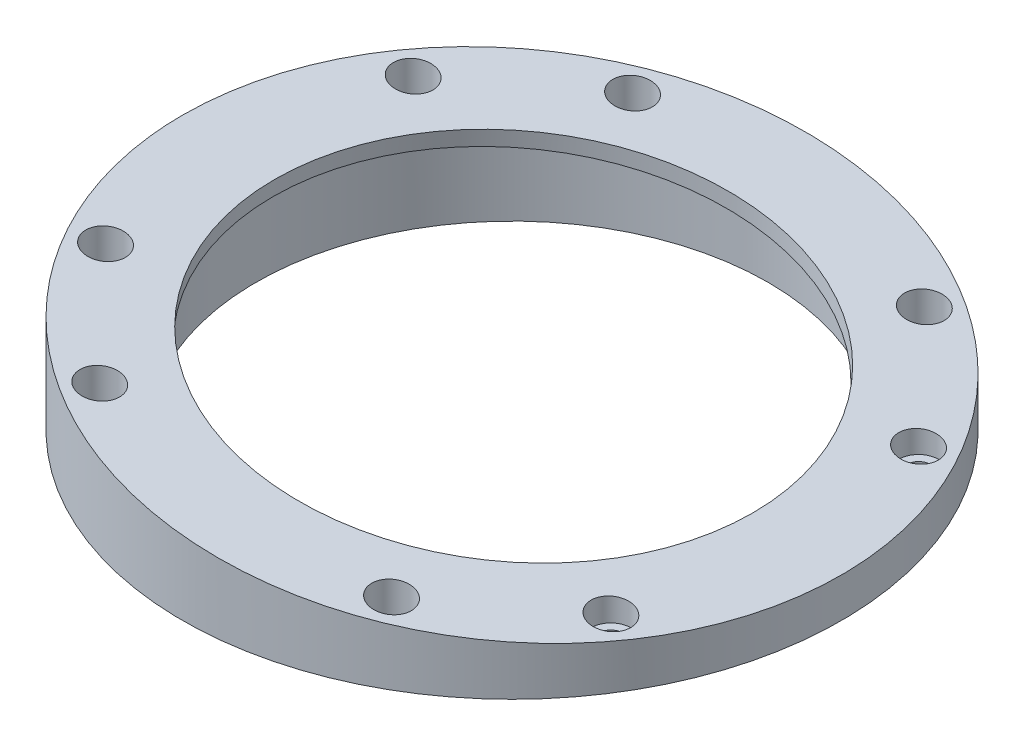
ISO-10303-21;
HEADER;
FILE_DESCRIPTION(('STEP AP214'),'2;1');
FILE_NAME('part.step','',(''),(''),'','','');
FILE_SCHEMA(('AUTOMOTIVE_DESIGN { 1 0 10303 214 1 1 1 1 }'));
ENDSEC;
DATA;
#1=APPLICATION_CONTEXT('core data for automotive mechanical design processes');
#2=APPLICATION_PROTOCOL_DEFINITION('international standard','automotive_design',2000,#1);
#3=PRODUCT_CONTEXT('',#1,'mechanical');
#4=PRODUCT('Part','Part','',(#3));
#5=PRODUCT_RELATED_PRODUCT_CATEGORY('part','',(#4));
#6=PRODUCT_DEFINITION_FORMATION('','',#4);
#7=PRODUCT_DEFINITION_CONTEXT('part definition',#1,'design');
#8=PRODUCT_DEFINITION('design','',#6,#7);
#9=PRODUCT_DEFINITION_SHAPE('','',#8);
#10=(LENGTH_UNIT() NAMED_UNIT(*) SI_UNIT(.MILLI.,.METRE.));
#11=(NAMED_UNIT(*) PLANE_ANGLE_UNIT() SI_UNIT($,.RADIAN.));
#12=(NAMED_UNIT(*) SI_UNIT($,.STERADIAN.) SOLID_ANGLE_UNIT());
#13=UNCERTAINTY_MEASURE_WITH_UNIT(LENGTH_MEASURE(1.E-05),#10,'distance_accuracy_value','');
#14=(GEOMETRIC_REPRESENTATION_CONTEXT(3) GLOBAL_UNCERTAINTY_ASSIGNED_CONTEXT((#13)) GLOBAL_UNIT_ASSIGNED_CONTEXT((#10,
#11,#12)) REPRESENTATION_CONTEXT('',''));
#15=CARTESIAN_POINT('',(0.,0.,0.));
#16=DIRECTION('',(0.,0.,1.));
#17=DIRECTION('',(1.,0.,0.));
#18=AXIS2_PLACEMENT_3D('',#15,#16,#17);
#19=CARTESIAN_POINT('',(127.,0.,127.));
#20=DIRECTION('',(0.,1.,0.));
#21=DIRECTION('',(0.,0.,1.));
#22=AXIS2_PLACEMENT_3D('',#19,#20,#21);
#23=CYLINDRICAL_SURFACE('',#22,66.167);
#24=CARTESIAN_POINT('',(127.,247.103942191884,127.));
#25=DIRECTION('',(-0.103660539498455,-0.994612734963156,0.));
#26=DIRECTION('',(-0.994612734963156,0.103660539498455,0.));
#27=AXIS2_PLACEMENT_3D('',#24,#25,#26);
#28=ELLIPSE('',#27,66.525389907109,66.167);
#29=CARTESIAN_POINT('',(60.833,254.,127.));
#30=VERTEX_POINT('',#29);
#31=EDGE_CURVE('E12',#30,#30,#28,.T.);
#32=ORIENTED_EDGE('',*,*,#31,.T.);
#33=EDGE_LOOP('',(#32));
#34=FACE_BOUND('',#33,.T.);
#35=CARTESIAN_POINT('',(127.,232.283,127.));
#36=DIRECTION('',(0.,-1.,0.));
#37=DIRECTION('',(0.,0.,-1.));
#38=AXIS2_PLACEMENT_3D('',#35,#36,#37);
#39=CIRCLE('',#38,66.167);
#40=CARTESIAN_POINT('',(127.,232.283,60.833));
#41=VERTEX_POINT('',#40);
#42=EDGE_CURVE('E50',#41,#41,#39,.T.);
#43=ORIENTED_EDGE('',*,*,#42,.F.);
#44=EDGE_LOOP('',(#43));
#45=FACE_BOUND('',#44,.T.);
#46=ADVANCED_FACE('F42',(#34,#45),#23,.T.);
#47=CARTESIAN_POINT('',(26.8416130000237,257.542650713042,60.832));
#48=DIRECTION('',(-0.103660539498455,-0.994612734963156,0.));
#49=DIRECTION('',(0.994612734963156,-0.103660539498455,0.));
#50=AXIS2_PLACEMENT_3D('',#47,#48,#49);
#51=PLANE('',#50);
#52=CARTESIAN_POINT('',(127.329122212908,247.069640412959,127.));
#53=DIRECTION('',(-0.103660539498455,-0.994612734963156,0.));
#54=DIRECTION('',(0.994612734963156,-0.103660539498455,0.));
#55=AXIS2_PLACEMENT_3D('',#52,#53,#54);
#56=CIRCLE('',#55,48.26);
#57=CARTESIAN_POINT('',(175.32913280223,242.066982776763,127.));
#58=VERTEX_POINT('',#57);
#59=EDGE_CURVE('E409',#58,#58,#56,.T.);
#60=ORIENTED_EDGE('',*,*,#59,.T.);
#61=EDGE_LOOP('',(#60));
#62=FACE_BOUND('',#61,.T.);
#63=CARTESIAN_POINT('',(75.6807048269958,252.452542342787,95.5336504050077));
#64=DIRECTION('',(-0.103660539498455,-0.994612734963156,0.));
#65=DIRECTION('',(-0.994612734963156,0.103660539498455,0.));
#66=AXIS2_PLACEMENT_3D('',#63,#64,#65);
#67=ELLIPSE('',#66,3.99024651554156,3.96874999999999);
#68=CARTESIAN_POINT('',(71.7119548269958,252.86617344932,95.5336504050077));
#69=VERTEX_POINT('',#68);
#70=EDGE_CURVE('E45',#69,#69,#67,.F.);
#71=ORIENTED_EDGE('',*,*,#70,.F.);
#72=EDGE_LOOP('',(#71));
#73=FACE_BOUND('',#72,.T.);
#74=CARTESIAN_POINT('',(158.46634274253,243.824456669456,75.6807202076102));
#75=DIRECTION('',(-0.103660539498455,-0.994612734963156,0.));
#76=DIRECTION('',(-0.994612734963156,0.103660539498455,0.));
#77=AXIS2_PLACEMENT_3D('',#74,#75,#76);
#78=ELLIPSE('',#77,3.99024651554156,3.96874999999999);
#79=CARTESIAN_POINT('',(154.49759274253,244.238087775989,75.6807202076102));
#80=VERTEX_POINT('',#79);
#81=EDGE_CURVE('E170',#80,#80,#78,.F.);
#82=ORIENTED_EDGE('',*,*,#81,.F.);
#83=EDGE_LOOP('',(#82));
#84=FACE_BOUND('',#83,.T.);
#85=CARTESIAN_POINT('',(179.910292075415,241.589525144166,98.2893713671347));
#86=DIRECTION('',(-0.103660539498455,-0.994612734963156,0.));
#87=DIRECTION('',(-0.994612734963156,0.103660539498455,0.));
#88=AXIS2_PLACEMENT_3D('',#85,#86,#87);
#89=ELLIPSE('',#88,3.99024651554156,3.96874999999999);
#90=CARTESIAN_POINT('',(175.941542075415,242.003156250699,98.2893713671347));
#91=VERTEX_POINT('',#90);
#92=EDGE_CURVE('E168',#91,#91,#89,.F.);
#93=ORIENTED_EDGE('',*,*,#92,.F.);
#94=EDGE_LOOP('',(#93));
#95=FACE_BOUND('',#94,.T.);
#96=CARTESIAN_POINT('',(178.319279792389,241.75534364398,158.466342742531));
#97=DIRECTION('',(-0.103660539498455,-0.994612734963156,0.));
#98=DIRECTION('',(-0.994612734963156,0.103660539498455,0.));
#99=AXIS2_PLACEMENT_3D('',#96,#97,#98);
#100=ELLIPSE('',#99,3.99024651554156,3.96874999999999);
#101=CARTESIAN_POINT('',(174.350529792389,242.168974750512,158.466342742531));
#102=VERTEX_POINT('',#101);
#103=EDGE_CURVE('E165',#102,#102,#100,.F.);
#104=ORIENTED_EDGE('',*,*,#103,.F.);
#105=EDGE_LOOP('',(#104));
#106=FACE_BOUND('',#105,.T.);
#107=CARTESIAN_POINT('',(155.710628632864,244.111662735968,179.910292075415));
#108=DIRECTION('',(-0.103660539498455,-0.994612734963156,0.));
#109=DIRECTION('',(-0.994612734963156,0.103660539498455,0.));
#110=AXIS2_PLACEMENT_3D('',#107,#108,#109);
#111=ELLIPSE('',#110,3.99024651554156,3.96874999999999);
#112=CARTESIAN_POINT('',(151.741878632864,244.525293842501,179.910292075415));
#113=VERTEX_POINT('',#112);
#114=EDGE_CURVE('E162',#113,#113,#111,.F.);
#115=ORIENTED_EDGE('',*,*,#114,.F.);
#116=EDGE_LOOP('',(#115));
#117=FACE_BOUND('',#116,.T.);
#118=CARTESIAN_POINT('',(95.5336572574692,250.383427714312,178.31927979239));
#119=DIRECTION('',(-0.103660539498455,-0.994612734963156,0.));
#120=DIRECTION('',(-0.994612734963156,0.103660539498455,0.));
#121=AXIS2_PLACEMENT_3D('',#118,#119,#120);
#122=ELLIPSE('',#121,3.99024651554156,3.96874999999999);
#123=CARTESIAN_POINT('',(91.5649072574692,250.797058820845,178.31927979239));
#124=VERTEX_POINT('',#123);
#125=EDGE_CURVE('E159',#124,#124,#122,.F.);
#126=ORIENTED_EDGE('',*,*,#125,.F.);
#127=EDGE_LOOP('',(#126));
#128=FACE_BOUND('',#127,.T.);
#129=CARTESIAN_POINT('',(74.0897079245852,252.618359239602,155.710628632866));
#130=DIRECTION('',(-0.103660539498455,-0.994612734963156,0.));
#131=DIRECTION('',(-0.994612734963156,0.103660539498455,0.));
#132=AXIS2_PLACEMENT_3D('',#129,#130,#131);
#133=ELLIPSE('',#132,3.99024651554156,3.96874999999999);
#134=CARTESIAN_POINT('',(70.1209579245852,253.031990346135,155.710628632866));
#135=VERTEX_POINT('',#134);
#136=EDGE_CURVE('E156',#135,#135,#133,.F.);
#137=ORIENTED_EDGE('',*,*,#136,.F.);
#138=EDGE_LOOP('',(#137));
#139=FACE_BOUND('',#138,.T.);
#140=CARTESIAN_POINT('',(98.2893559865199,250.096223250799,74.0897010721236));
#141=DIRECTION('',(-0.103660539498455,-0.994612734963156,0.));
#142=DIRECTION('',(-0.994612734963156,0.103660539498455,0.));
#143=AXIS2_PLACEMENT_3D('',#140,#141,#142);
#144=ELLIPSE('',#143,3.99024651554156,3.96874999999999);
#145=CARTESIAN_POINT('',(94.3206059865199,250.509854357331,74.0897010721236));
#146=VERTEX_POINT('',#145);
#147=EDGE_CURVE('E153',#146,#146,#144,.F.);
#148=ORIENTED_EDGE('',*,*,#147,.F.);
#149=EDGE_LOOP('',(#148));
#150=FACE_BOUND('',#149,.T.);
#151=ORIENTED_EDGE('',*,*,#31,.F.);
#152=EDGE_LOOP('',(#151));
#153=FACE_BOUND('',#152,.T.);
#154=ADVANCED_FACE('F214',(#62,#73,#84,#95,#106,#117,#128,#139,#150,#153),#51,.F.);
#155=CARTESIAN_POINT('',(127.,232.283,127.));
#156=DIRECTION('',(0.,-1.,0.));
#157=DIRECTION('',(0.,0.,-1.));
#158=AXIS2_PLACEMENT_3D('',#155,#156,#157);
#159=PLANE('',#158);
#160=CARTESIAN_POINT('',(127.,232.283,127.));
#161=DIRECTION('',(0.,-1.,0.));
#162=DIRECTION('',(0.,0.,-1.));
#163=AXIS2_PLACEMENT_3D('',#160,#161,#162);
#164=CIRCLE('',#163,51.435);
#165=CARTESIAN_POINT('',(127.,232.283,75.565));
#166=VERTEX_POINT('',#165);
#167=EDGE_CURVE('E410',#166,#166,#164,.T.);
#168=ORIENTED_EDGE('',*,*,#167,.F.);
#169=EDGE_LOOP('',(#168));
#170=FACE_BOUND('',#169,.T.);
#171=CARTESIAN_POINT('',(158.46634274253,232.283,75.6807202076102));
#172=DIRECTION('',(0.,-1.,0.));
#173=DIRECTION('',(0.,0.,-1.));
#174=AXIS2_PLACEMENT_3D('',#171,#172,#173);
#175=CIRCLE('',#174,2.2479);
#176=CARTESIAN_POINT('',(158.46634274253,232.283,73.4328202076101));
#177=VERTEX_POINT('',#176);
#178=EDGE_CURVE('E175',#177,#177,#175,.T.);
#179=ORIENTED_EDGE('',*,*,#178,.F.);
#180=EDGE_LOOP('',(#179));
#181=FACE_BOUND('',#180,.T.);
#182=CARTESIAN_POINT('',(179.910292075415,232.283,98.2893713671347));
#183=DIRECTION('',(0.,-1.,0.));
#184=DIRECTION('',(0.,0.,-1.));
#185=AXIS2_PLACEMENT_3D('',#182,#183,#184);
#186=CIRCLE('',#185,2.2479);
#187=CARTESIAN_POINT('',(179.910292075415,232.283,96.0414713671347));
#188=VERTEX_POINT('',#187);
#189=EDGE_CURVE('E179',#188,#188,#186,.T.);
#190=ORIENTED_EDGE('',*,*,#189,.F.);
#191=EDGE_LOOP('',(#190));
#192=FACE_BOUND('',#191,.T.);
#193=CARTESIAN_POINT('',(178.319279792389,232.283,158.466342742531));
#194=DIRECTION('',(0.,-1.,0.));
#195=DIRECTION('',(0.,0.,-1.));
#196=AXIS2_PLACEMENT_3D('',#193,#194,#195);
#197=CIRCLE('',#196,2.2479);
#198=CARTESIAN_POINT('',(178.319279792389,232.283,156.218442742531));
#199=VERTEX_POINT('',#198);
#200=EDGE_CURVE('E184',#199,#199,#197,.T.);
#201=ORIENTED_EDGE('',*,*,#200,.F.);
#202=EDGE_LOOP('',(#201));
#203=FACE_BOUND('',#202,.T.);
#204=CARTESIAN_POINT('',(155.710628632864,232.283,179.910292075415));
#205=DIRECTION('',(0.,-1.,0.));
#206=DIRECTION('',(0.,0.,-1.));
#207=AXIS2_PLACEMENT_3D('',#204,#205,#206);
#208=CIRCLE('',#207,2.2479);
#209=CARTESIAN_POINT('',(155.710628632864,232.283,177.662392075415));
#210=VERTEX_POINT('',#209);
#211=EDGE_CURVE('E191',#210,#210,#208,.T.);
#212=ORIENTED_EDGE('',*,*,#211,.F.);
#213=EDGE_LOOP('',(#212));
#214=FACE_BOUND('',#213,.T.);
#215=CARTESIAN_POINT('',(95.5336572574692,232.283,178.31927979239));
#216=DIRECTION('',(0.,-1.,0.));
#217=DIRECTION('',(0.,0.,-1.));
#218=AXIS2_PLACEMENT_3D('',#215,#216,#217);
#219=CIRCLE('',#218,2.2479);
#220=CARTESIAN_POINT('',(95.5336572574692,232.283,176.07137979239));
#221=VERTEX_POINT('',#220);
#222=EDGE_CURVE('E194',#221,#221,#219,.T.);
#223=ORIENTED_EDGE('',*,*,#222,.F.);
#224=EDGE_LOOP('',(#223));
#225=FACE_BOUND('',#224,.T.);
#226=CARTESIAN_POINT('',(74.0897079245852,232.283,155.710628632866));
#227=DIRECTION('',(0.,-1.,0.));
#228=DIRECTION('',(0.,0.,-1.));
#229=AXIS2_PLACEMENT_3D('',#226,#227,#228);
#230=CIRCLE('',#229,2.2479);
#231=CARTESIAN_POINT('',(74.0897079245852,232.283,153.462728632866));
#232=VERTEX_POINT('',#231);
#233=EDGE_CURVE('E197',#232,#232,#230,.T.);
#234=ORIENTED_EDGE('',*,*,#233,.F.);
#235=EDGE_LOOP('',(#234));
#236=FACE_BOUND('',#235,.T.);
#237=CARTESIAN_POINT('',(75.6807048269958,232.283,95.5336504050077));
#238=DIRECTION('',(0.,-1.,0.));
#239=DIRECTION('',(0.,0.,-1.));
#240=AXIS2_PLACEMENT_3D('',#237,#238,#239);
#241=CIRCLE('',#240,2.2479);
#242=CARTESIAN_POINT('',(75.6807048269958,232.283,93.2857504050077));
#243=VERTEX_POINT('',#242);
#244=EDGE_CURVE('E200',#243,#243,#241,.T.);
#245=ORIENTED_EDGE('',*,*,#244,.F.);
#246=EDGE_LOOP('',(#245));
#247=FACE_BOUND('',#246,.T.);
#248=CARTESIAN_POINT('',(98.2893559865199,232.283,74.0897010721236));
#249=DIRECTION('',(0.,-1.,0.));
#250=DIRECTION('',(0.,0.,-1.));
#251=AXIS2_PLACEMENT_3D('',#248,#249,#250);
#252=CIRCLE('',#251,2.2479);
#253=CARTESIAN_POINT('',(98.2893559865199,232.283,71.8418010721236));
#254=VERTEX_POINT('',#253);
#255=EDGE_CURVE('E203',#254,#254,#252,.T.);
#256=ORIENTED_EDGE('',*,*,#255,.F.);
#257=EDGE_LOOP('',(#256));
#258=FACE_BOUND('',#257,.T.);
#259=CARTESIAN_POINT('',(67.2038955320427,232.283,125.419057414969));
#260=DIRECTION('',(0.,-1.,0.));
#261=DIRECTION('',(0.,0.,-1.));
#262=AXIS2_PLACEMENT_3D('',#259,#260,#261);
#263=CIRCLE('',#262,2.0574);
#264=CARTESIAN_POINT('',(67.2038955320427,232.283,123.361657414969));
#265=VERTEX_POINT('',#264);
#266=EDGE_CURVE('E87',#265,#265,#263,.T.);
#267=ORIENTED_EDGE('',*,*,#266,.F.);
#268=EDGE_LOOP('',(#267));
#269=FACE_BOUND('',#268,.T.);
#270=CARTESIAN_POINT('',(128.580942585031,232.283,67.2038955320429));
#271=DIRECTION('',(0.,-1.,0.));
#272=DIRECTION('',(0.,0.,-1.));
#273=AXIS2_PLACEMENT_3D('',#270,#271,#272);
#274=CIRCLE('',#273,2.05739999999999);
#275=CARTESIAN_POINT('',(128.580942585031,232.283,65.1464955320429));
#276=VERTEX_POINT('',#275);
#277=EDGE_CURVE('E80',#276,#276,#274,.T.);
#278=ORIENTED_EDGE('',*,*,#277,.F.);
#279=EDGE_LOOP('',(#278));
#280=FACE_BOUND('',#279,.T.);
#281=CARTESIAN_POINT('',(186.796104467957,232.283,128.580942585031));
#282=DIRECTION('',(0.,-1.,0.));
#283=DIRECTION('',(0.,0.,-1.));
#284=AXIS2_PLACEMENT_3D('',#281,#282,#283);
#285=CIRCLE('',#284,2.05739999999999);
#286=CARTESIAN_POINT('',(186.796104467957,232.283,126.523542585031));
#287=VERTEX_POINT('',#286);
#288=EDGE_CURVE('E96',#287,#287,#285,.T.);
#289=ORIENTED_EDGE('',*,*,#288,.F.);
#290=EDGE_LOOP('',(#289));
#291=FACE_BOUND('',#290,.T.);
#292=CARTESIAN_POINT('',(125.419057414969,232.283,186.796104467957));
#293=DIRECTION('',(0.,-1.,0.));
#294=DIRECTION('',(0.,0.,-1.));
#295=AXIS2_PLACEMENT_3D('',#292,#293,#294);
#296=CIRCLE('',#295,2.05740000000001);
#297=CARTESIAN_POINT('',(125.419057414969,232.283,184.738704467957));
#298=VERTEX_POINT('',#297);
#299=EDGE_CURVE('E105',#298,#298,#296,.T.);
#300=ORIENTED_EDGE('',*,*,#299,.F.);
#301=EDGE_LOOP('',(#300));
#302=FACE_BOUND('',#301,.T.);
#303=CARTESIAN_POINT('',(168.465088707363,232.283,87.6710168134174));
#304=DIRECTION('',(0.,-1.,0.));
#305=DIRECTION('',(0.,0.,-1.));
#306=AXIS2_PLACEMENT_3D('',#303,#304,#305);
#307=CIRCLE('',#306,0.793749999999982);
#308=CARTESIAN_POINT('',(168.465088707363,232.283,86.8772668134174));
#309=VERTEX_POINT('',#308);
#310=EDGE_CURVE('E114',#309,#309,#307,.T.);
#311=ORIENTED_EDGE('',*,*,#310,.F.);
#312=EDGE_LOOP('',(#311));
#313=FACE_BOUND('',#312,.T.);
#314=CARTESIAN_POINT('',(85.5349112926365,232.283,166.328983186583));
#315=DIRECTION('',(0.,-1.,0.));
#316=DIRECTION('',(0.,0.,-1.));
#317=AXIS2_PLACEMENT_3D('',#314,#315,#316);
#318=CIRCLE('',#317,0.793749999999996);
#319=CARTESIAN_POINT('',(85.5349112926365,232.283,165.535233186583));
#320=VERTEX_POINT('',#319);
#321=EDGE_CURVE('E120',#320,#320,#318,.T.);
#322=ORIENTED_EDGE('',*,*,#321,.F.);
#323=EDGE_LOOP('',(#322));
#324=FACE_BOUND('',#323,.T.);
#325=ORIENTED_EDGE('',*,*,#42,.T.);
#326=EDGE_LOOP('',(#325));
#327=FACE_BOUND('',#326,.T.);
#328=ADVANCED_FACE('F210',(#170,#181,#192,#203,#214,#225,#236,#247,#258,#269,#280,#291,#302,
#313,#324,#327),#159,.T.);
#329=CARTESIAN_POINT('',(26.5124907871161,254.384755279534,60.832));
#330=DIRECTION('',(-0.103660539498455,-0.994612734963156,0.));
#331=DIRECTION('',(0.994612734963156,-0.103660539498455,0.));
#332=AXIS2_PLACEMENT_3D('',#329,#330,#331);
#333=PLANE('',#332);
#334=CARTESIAN_POINT('',(127.,243.911744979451,127.));
#335=DIRECTION('',(-0.103660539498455,-0.994612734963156,0.));
#336=DIRECTION('',(0.994612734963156,-0.103660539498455,0.));
#337=AXIS2_PLACEMENT_3D('',#334,#335,#336);
#338=CIRCLE('',#337,48.26);
#339=CARTESIAN_POINT('',(175.000010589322,238.909087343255,127.));
#340=VERTEX_POINT('',#339);
#341=EDGE_CURVE('E407',#340,#340,#338,.T.);
#342=ORIENTED_EDGE('',*,*,#341,.F.);
#343=EDGE_LOOP('',(#342));
#344=FACE_BOUND('',#343,.T.);
#345=CARTESIAN_POINT('',(127.,243.911744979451,127.));
#346=DIRECTION('',(-0.103660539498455,-0.994612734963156,0.));
#347=DIRECTION('',(0.994612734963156,-0.103660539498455,0.));
#348=AXIS2_PLACEMENT_3D('',#345,#346,#347);
#349=ELLIPSE('',#348,51.7135948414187,51.435);
#350=CARTESIAN_POINT('',(178.435,238.551085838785,127.));
#351=VERTEX_POINT('',#350);
#352=EDGE_CURVE('E413',#351,#351,#349,.F.);
#353=ORIENTED_EDGE('',*,*,#352,.F.);
#354=EDGE_LOOP('',(#353));
#355=FACE_BOUND('',#354,.T.);
#356=ADVANCED_FACE('F213',(#344,#355),#333,.T.);
#357=CARTESIAN_POINT('',(85.5349112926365,238.633,166.328983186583));
#358=DIRECTION('',(0.,-1.,0.));
#359=DIRECTION('',(0.,0.,-1.));
#360=AXIS2_PLACEMENT_3D('',#357,#358,#359);
#361=CONICAL_SURFACE('',#360,0.793749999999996,1.02974425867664);
#362=CARTESIAN_POINT('',(85.5349112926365,239.109933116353,166.328983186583));
#363=VERTEX_POINT('',#362);
#364=VERTEX_LOOP('',#363);
#365=FACE_BOUND('',#364,.T.);
#366=CARTESIAN_POINT('',(85.5349112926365,238.633,166.328983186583));
#367=DIRECTION('',(0.,-1.,0.));
#368=DIRECTION('',(0.,0.,-1.));
#369=AXIS2_PLACEMENT_3D('',#366,#367,#368);
#370=CIRCLE('',#369,0.793749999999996);
#371=CARTESIAN_POINT('',(85.5349112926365,238.633,165.535233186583));
#372=VERTEX_POINT('',#371);
#373=EDGE_CURVE('E123',#372,#372,#370,.T.);
#374=ORIENTED_EDGE('',*,*,#373,.T.);
#375=EDGE_LOOP('',(#374));
#376=FACE_BOUND('',#375,.T.);
#377=ADVANCED_FACE('F244',(#365,#376),#361,.F.);
#378=CARTESIAN_POINT('',(85.5349112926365,232.283,166.328983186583));
#379=DIRECTION('',(0.,-1.,0.));
#380=DIRECTION('',(0.,0.,-1.));
#381=AXIS2_PLACEMENT_3D('',#378,#379,#380);
#382=CYLINDRICAL_SURFACE('',#381,0.793749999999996);
#383=ORIENTED_EDGE('',*,*,#373,.F.);
#384=EDGE_LOOP('',(#383));
#385=FACE_BOUND('',#384,.T.);
#386=ORIENTED_EDGE('',*,*,#321,.T.);
#387=EDGE_LOOP('',(#386));
#388=FACE_BOUND('',#387,.T.);
#389=ADVANCED_FACE('F248',(#385,#388),#382,.F.);
#390=CARTESIAN_POINT('',(168.465088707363,238.633,87.6710168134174));
#391=DIRECTION('',(0.,-1.,0.));
#392=DIRECTION('',(0.,0.,-1.));
#393=AXIS2_PLACEMENT_3D('',#390,#391,#392);
#394=CONICAL_SURFACE('',#393,0.79375000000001,1.02974425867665);
#395=CARTESIAN_POINT('',(168.465088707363,239.109933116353,87.6710168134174));
#396=VERTEX_POINT('',#395);
#397=VERTEX_LOOP('',#396);
#398=FACE_BOUND('',#397,.T.);
#399=CARTESIAN_POINT('',(168.465088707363,238.633,87.6710168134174));
#400=DIRECTION('',(0.,-1.,0.));
#401=DIRECTION('',(0.,0.,-1.));
#402=AXIS2_PLACEMENT_3D('',#399,#400,#401);
#403=CIRCLE('',#402,0.79375000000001);
#404=CARTESIAN_POINT('',(168.465088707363,238.633,86.8772668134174));
#405=VERTEX_POINT('',#404);
#406=EDGE_CURVE('E117',#405,#405,#403,.T.);
#407=ORIENTED_EDGE('',*,*,#406,.T.);
#408=EDGE_LOOP('',(#407));
#409=FACE_BOUND('',#408,.T.);
#410=ADVANCED_FACE('F251',(#398,#409),#394,.F.);
#411=CARTESIAN_POINT('',(168.465088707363,232.283,87.6710168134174));
#412=DIRECTION('',(0.,-1.,0.));
#413=DIRECTION('',(0.,0.,-1.));
#414=AXIS2_PLACEMENT_3D('',#411,#412,#413);
#415=CYLINDRICAL_SURFACE('',#414,0.793749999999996);
#416=ORIENTED_EDGE('',*,*,#406,.F.);
#417=EDGE_LOOP('',(#416));
#418=FACE_BOUND('',#417,.T.);
#419=ORIENTED_EDGE('',*,*,#310,.T.);
#420=EDGE_LOOP('',(#419));
#421=FACE_BOUND('',#420,.T.);
#422=ADVANCED_FACE('F255',(#418,#421),#415,.F.);
#423=CARTESIAN_POINT('',(125.419057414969,238.633,186.796104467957));
#424=DIRECTION('',(0.,-1.,0.));
#425=DIRECTION('',(0.,0.,-1.));
#426=AXIS2_PLACEMENT_3D('',#423,#424,#425);
#427=CONICAL_SURFACE('',#426,1.1303,1.02974425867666);
#428=CARTESIAN_POINT('',(125.419057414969,239.312152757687,186.796104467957));
#429=VERTEX_POINT('',#428);
#430=VERTEX_LOOP('',#429);
#431=FACE_BOUND('',#430,.T.);
#432=CARTESIAN_POINT('',(125.419057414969,238.633,186.796104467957));
#433=DIRECTION('',(0.,-1.,0.));
#434=DIRECTION('',(0.,0.,-1.));
#435=AXIS2_PLACEMENT_3D('',#432,#433,#434);
#436=CIRCLE('',#435,1.1303);
#437=CARTESIAN_POINT('',(125.419057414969,238.633,185.665804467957));
#438=VERTEX_POINT('',#437);
#439=EDGE_CURVE('E111',#438,#438,#436,.T.);
#440=ORIENTED_EDGE('',*,*,#439,.T.);
#441=EDGE_LOOP('',(#440));
#442=FACE_BOUND('',#441,.T.);
#443=ADVANCED_FACE('F258',(#431,#442),#427,.F.);
#444=CARTESIAN_POINT('',(125.419057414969,232.283,186.796104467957));
#445=DIRECTION('',(0.,-1.,0.));
#446=DIRECTION('',(0.,0.,-1.));
#447=AXIS2_PLACEMENT_3D('',#444,#445,#446);
#448=CYLINDRICAL_SURFACE('',#447,1.1303);
#449=ORIENTED_EDGE('',*,*,#439,.F.);
#450=EDGE_LOOP('',(#449));
#451=FACE_BOUND('',#450,.T.);
#452=CARTESIAN_POINT('',(125.419057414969,233.060929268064,186.796104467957));
#453=DIRECTION('',(0.,-1.,0.));
#454=DIRECTION('',(0.,0.,-1.));
#455=AXIS2_PLACEMENT_3D('',#452,#453,#454);
#456=CIRCLE('',#455,1.1303);
#457=CARTESIAN_POINT('',(125.419057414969,233.060929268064,185.665804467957));
#458=VERTEX_POINT('',#457);
#459=EDGE_CURVE('E108',#458,#458,#456,.T.);
#460=ORIENTED_EDGE('',*,*,#459,.T.);
#461=EDGE_LOOP('',(#460));
#462=FACE_BOUND('',#461,.T.);
#463=ADVANCED_FACE('F262',(#451,#462),#448,.F.);
#464=CARTESIAN_POINT('',(125.419057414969,232.283,186.796104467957));
#465=DIRECTION('',(0.,-1.,0.));
#466=DIRECTION('',(0.,0.,-1.));
#467=AXIS2_PLACEMENT_3D('',#464,#465,#466);
#468=CONICAL_SURFACE('',#467,2.05740000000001,0.872664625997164);
#469=ORIENTED_EDGE('',*,*,#459,.F.);
#470=EDGE_LOOP('',(#469));
#471=FACE_BOUND('',#470,.T.);
#472=ORIENTED_EDGE('',*,*,#299,.T.);
#473=EDGE_LOOP('',(#472));
#474=FACE_BOUND('',#473,.T.);
#475=ADVANCED_FACE('F266',(#471,#474),#468,.F.);
#476=CARTESIAN_POINT('',(186.796104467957,238.633,128.580942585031));
#477=DIRECTION('',(0.,-1.,0.));
#478=DIRECTION('',(0.,0.,-1.));
#479=AXIS2_PLACEMENT_3D('',#476,#477,#478);
#480=CONICAL_SURFACE('',#479,1.1303,1.02974425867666);
#481=CARTESIAN_POINT('',(186.796104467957,239.312152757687,128.580942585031));
#482=VERTEX_POINT('',#481);
#483=VERTEX_LOOP('',#482);
#484=FACE_BOUND('',#483,.T.);
#485=CARTESIAN_POINT('',(186.796104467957,238.633,128.580942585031));
#486=DIRECTION('',(0.,-1.,0.));
#487=DIRECTION('',(0.,0.,-1.));
#488=AXIS2_PLACEMENT_3D('',#485,#486,#487);
#489=CIRCLE('',#488,1.1303);
#490=CARTESIAN_POINT('',(186.796104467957,238.633,127.450642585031));
#491=VERTEX_POINT('',#490);
#492=EDGE_CURVE('E102',#491,#491,#489,.T.);
#493=ORIENTED_EDGE('',*,*,#492,.T.);
#494=EDGE_LOOP('',(#493));
#495=FACE_BOUND('',#494,.T.);
#496=ADVANCED_FACE('F270',(#484,#495),#480,.F.);
#497=CARTESIAN_POINT('',(186.796104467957,232.283,128.580942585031));
#498=DIRECTION('',(0.,-1.,0.));
#499=DIRECTION('',(0.,0.,-1.));
#500=AXIS2_PLACEMENT_3D('',#497,#498,#499);
#501=CYLINDRICAL_SURFACE('',#500,1.1303);
#502=ORIENTED_EDGE('',*,*,#492,.F.);
#503=EDGE_LOOP('',(#502));
#504=FACE_BOUND('',#503,.T.);
#505=CARTESIAN_POINT('',(186.796104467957,233.060929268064,128.580942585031));
#506=DIRECTION('',(0.,-1.,0.));
#507=DIRECTION('',(0.,0.,-1.));
#508=AXIS2_PLACEMENT_3D('',#505,#506,#507);
#509=CIRCLE('',#508,1.1303);
#510=CARTESIAN_POINT('',(186.796104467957,233.060929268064,127.450642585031));
#511=VERTEX_POINT('',#510);
#512=EDGE_CURVE('E99',#511,#511,#509,.T.);
#513=ORIENTED_EDGE('',*,*,#512,.T.);
#514=EDGE_LOOP('',(#513));
#515=FACE_BOUND('',#514,.T.);
#516=ADVANCED_FACE('F274',(#504,#515),#501,.F.);
#517=CARTESIAN_POINT('',(186.796104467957,232.283,128.580942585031));
#518=DIRECTION('',(0.,-1.,0.));
#519=DIRECTION('',(0.,0.,-1.));
#520=AXIS2_PLACEMENT_3D('',#517,#518,#519);
#521=CONICAL_SURFACE('',#520,2.05739999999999,0.872664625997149);
#522=ORIENTED_EDGE('',*,*,#512,.F.);
#523=EDGE_LOOP('',(#522));
#524=FACE_BOUND('',#523,.T.);
#525=ORIENTED_EDGE('',*,*,#288,.T.);
#526=EDGE_LOOP('',(#525));
#527=FACE_BOUND('',#526,.T.);
#528=ADVANCED_FACE('F278',(#524,#527),#521,.F.);
#529=CARTESIAN_POINT('',(128.580942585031,238.633,67.2038955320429));
#530=DIRECTION('',(0.,-1.,0.));
#531=DIRECTION('',(0.,0.,-1.));
#532=AXIS2_PLACEMENT_3D('',#529,#530,#531);
#533=CONICAL_SURFACE('',#532,1.1303,1.02974425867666);
#534=CARTESIAN_POINT('',(128.580942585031,239.312152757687,67.2038955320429));
#535=VERTEX_POINT('',#534);
#536=VERTEX_LOOP('',#535);
#537=FACE_BOUND('',#536,.T.);
#538=CARTESIAN_POINT('',(128.580942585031,238.633,67.2038955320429));
#539=DIRECTION('',(0.,-1.,0.));
#540=DIRECTION('',(0.,0.,-1.));
#541=AXIS2_PLACEMENT_3D('',#538,#539,#540);
#542=CIRCLE('',#541,1.1303);
#543=CARTESIAN_POINT('',(128.580942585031,238.633,66.0735955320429));
#544=VERTEX_POINT('',#543);
#545=EDGE_CURVE('E93',#544,#544,#542,.T.);
#546=ORIENTED_EDGE('',*,*,#545,.T.);
#547=EDGE_LOOP('',(#546));
#548=FACE_BOUND('',#547,.T.);
#549=ADVANCED_FACE('F282',(#537,#548),#533,.F.);
#550=CARTESIAN_POINT('',(128.580942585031,232.283,67.2038955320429));
#551=DIRECTION('',(0.,-1.,0.));
#552=DIRECTION('',(0.,0.,-1.));
#553=AXIS2_PLACEMENT_3D('',#550,#551,#552);
#554=CYLINDRICAL_SURFACE('',#553,1.1303);
#555=ORIENTED_EDGE('',*,*,#545,.F.);
#556=EDGE_LOOP('',(#555));
#557=FACE_BOUND('',#556,.T.);
#558=CARTESIAN_POINT('',(128.580942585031,233.060929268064,67.2038955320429));
#559=DIRECTION('',(0.,-1.,0.));
#560=DIRECTION('',(0.,0.,-1.));
#561=AXIS2_PLACEMENT_3D('',#558,#559,#560);
#562=CIRCLE('',#561,1.1303);
#563=CARTESIAN_POINT('',(128.580942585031,233.060929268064,66.0735955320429));
#564=VERTEX_POINT('',#563);
#565=EDGE_CURVE('E84',#564,#564,#562,.T.);
#566=ORIENTED_EDGE('',*,*,#565,.T.);
#567=EDGE_LOOP('',(#566));
#568=FACE_BOUND('',#567,.T.);
#569=ADVANCED_FACE('F286',(#557,#568),#554,.F.);
#570=CARTESIAN_POINT('',(128.580942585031,232.283,67.2038955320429));
#571=DIRECTION('',(0.,-1.,0.));
#572=DIRECTION('',(0.,0.,-1.));
#573=AXIS2_PLACEMENT_3D('',#570,#571,#572);
#574=CONICAL_SURFACE('',#573,2.05739999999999,0.872664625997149);
#575=ORIENTED_EDGE('',*,*,#565,.F.);
#576=EDGE_LOOP('',(#575));
#577=FACE_BOUND('',#576,.T.);
#578=ORIENTED_EDGE('',*,*,#277,.T.);
#579=EDGE_LOOP('',(#578));
#580=FACE_BOUND('',#579,.T.);
#581=ADVANCED_FACE('F74',(#577,#580),#574,.F.);
#582=CARTESIAN_POINT('',(67.2038955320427,238.633,125.419057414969));
#583=DIRECTION('',(0.,-1.,0.));
#584=DIRECTION('',(0.,0.,-1.));
#585=AXIS2_PLACEMENT_3D('',#582,#583,#584);
#586=CONICAL_SURFACE('',#585,1.1303,1.02974425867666);
#587=CARTESIAN_POINT('',(67.2038955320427,239.312152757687,125.419057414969));
#588=VERTEX_POINT('',#587);
#589=VERTEX_LOOP('',#588);
#590=FACE_BOUND('',#589,.T.);
#591=CARTESIAN_POINT('',(67.2038955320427,238.633,125.419057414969));
#592=DIRECTION('',(0.,-1.,0.));
#593=DIRECTION('',(0.,0.,-1.));
#594=AXIS2_PLACEMENT_3D('',#591,#592,#593);
#595=CIRCLE('',#594,1.1303);
#596=CARTESIAN_POINT('',(67.2038955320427,238.633,124.288757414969));
#597=VERTEX_POINT('',#596);
#598=EDGE_CURVE('E78',#597,#597,#595,.T.);
#599=ORIENTED_EDGE('',*,*,#598,.T.);
#600=EDGE_LOOP('',(#599));
#601=FACE_BOUND('',#600,.T.);
#602=ADVANCED_FACE('F70',(#590,#601),#586,.F.);
#603=CARTESIAN_POINT('',(67.2038955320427,232.283,125.419057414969));
#604=DIRECTION('',(0.,-1.,0.));
#605=DIRECTION('',(0.,0.,-1.));
#606=AXIS2_PLACEMENT_3D('',#603,#604,#605);
#607=CYLINDRICAL_SURFACE('',#606,1.1303);
#608=ORIENTED_EDGE('',*,*,#598,.F.);
#609=EDGE_LOOP('',(#608));
#610=FACE_BOUND('',#609,.T.);
#611=CARTESIAN_POINT('',(67.2038955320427,233.060929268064,125.419057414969));
#612=DIRECTION('',(0.,-1.,0.));
#613=DIRECTION('',(0.,0.,-1.));
#614=AXIS2_PLACEMENT_3D('',#611,#612,#613);
#615=CIRCLE('',#614,1.1303);
#616=CARTESIAN_POINT('',(67.2038955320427,233.060929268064,124.288757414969));
#617=VERTEX_POINT('',#616);
#618=EDGE_CURVE('E81',#617,#617,#615,.T.);
#619=ORIENTED_EDGE('',*,*,#618,.T.);
#620=EDGE_LOOP('',(#619));
#621=FACE_BOUND('',#620,.T.);
#622=ADVANCED_FACE('F73',(#610,#621),#607,.F.);
#623=CARTESIAN_POINT('',(67.2038955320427,232.283,125.419057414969));
#624=DIRECTION('',(0.,-1.,0.));
#625=DIRECTION('',(0.,0.,-1.));
#626=AXIS2_PLACEMENT_3D('',#623,#624,#625);
#627=CONICAL_SURFACE('',#626,2.0574,0.872664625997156);
#628=ORIENTED_EDGE('',*,*,#618,.F.);
#629=EDGE_LOOP('',(#628));
#630=FACE_BOUND('',#629,.T.);
#631=ORIENTED_EDGE('',*,*,#266,.T.);
#632=EDGE_LOOP('',(#631));
#633=FACE_BOUND('',#632,.T.);
#634=ADVANCED_FACE('F208',(#630,#633),#627,.F.);
#635=CARTESIAN_POINT('',(98.2893559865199,232.283,74.0897010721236));
#636=DIRECTION('',(0.,-1.,0.));
#637=DIRECTION('',(0.,0.,-1.));
#638=AXIS2_PLACEMENT_3D('',#635,#636,#637);
#639=CYLINDRICAL_SURFACE('',#638,2.2479);
#640=CARTESIAN_POINT('',(98.2893559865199,237.363,74.0897010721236));
#641=DIRECTION('',(0.,-1.,0.));
#642=DIRECTION('',(0.,0.,-1.));
#643=AXIS2_PLACEMENT_3D('',#640,#641,#642);
#644=CIRCLE('',#643,2.2479);
#645=CARTESIAN_POINT('',(98.2893559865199,237.363,71.8418010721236));
#646=VERTEX_POINT('',#645);
#647=EDGE_CURVE('E150',#646,#646,#644,.F.);
#648=ORIENTED_EDGE('',*,*,#647,.T.);
#649=EDGE_LOOP('',(#648));
#650=FACE_BOUND('',#649,.T.);
#651=ORIENTED_EDGE('',*,*,#255,.T.);
#652=EDGE_LOOP('',(#651));
#653=FACE_BOUND('',#652,.T.);
#654=ADVANCED_FACE('F298',(#650,#653),#639,.F.);
#655=CARTESIAN_POINT('',(75.6807048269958,232.283,95.5336504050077));
#656=DIRECTION('',(0.,-1.,0.));
#657=DIRECTION('',(0.,0.,-1.));
#658=AXIS2_PLACEMENT_3D('',#655,#656,#657);
#659=CYLINDRICAL_SURFACE('',#658,2.2479);
#660=CARTESIAN_POINT('',(75.6807048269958,237.363,95.5336504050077));
#661=DIRECTION('',(0.,-1.,0.));
#662=DIRECTION('',(0.,0.,-1.));
#663=AXIS2_PLACEMENT_3D('',#660,#661,#662);
#664=CIRCLE('',#663,2.2479);
#665=CARTESIAN_POINT('',(75.6807048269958,237.363,93.2857504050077));
#666=VERTEX_POINT('',#665);
#667=EDGE_CURVE('E147',#666,#666,#664,.F.);
#668=ORIENTED_EDGE('',*,*,#667,.T.);
#669=EDGE_LOOP('',(#668));
#670=FACE_BOUND('',#669,.T.);
#671=ORIENTED_EDGE('',*,*,#244,.T.);
#672=EDGE_LOOP('',(#671));
#673=FACE_BOUND('',#672,.T.);
#674=ADVANCED_FACE('F302',(#670,#673),#659,.F.);
#675=CARTESIAN_POINT('',(74.0897079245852,232.283,155.710628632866));
#676=DIRECTION('',(0.,-1.,0.));
#677=DIRECTION('',(0.,0.,-1.));
#678=AXIS2_PLACEMENT_3D('',#675,#676,#677);
#679=CYLINDRICAL_SURFACE('',#678,2.2479);
#680=CARTESIAN_POINT('',(74.0897079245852,237.363,155.710628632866));
#681=DIRECTION('',(0.,-1.,0.));
#682=DIRECTION('',(0.,0.,-1.));
#683=AXIS2_PLACEMENT_3D('',#680,#681,#682);
#684=CIRCLE('',#683,2.2479);
#685=CARTESIAN_POINT('',(74.0897079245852,237.363,153.462728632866));
#686=VERTEX_POINT('',#685);
#687=EDGE_CURVE('E144',#686,#686,#684,.F.);
#688=ORIENTED_EDGE('',*,*,#687,.T.);
#689=EDGE_LOOP('',(#688));
#690=FACE_BOUND('',#689,.T.);
#691=ORIENTED_EDGE('',*,*,#233,.T.);
#692=EDGE_LOOP('',(#691));
#693=FACE_BOUND('',#692,.T.);
#694=ADVANCED_FACE('F306',(#690,#693),#679,.F.);
#695=CARTESIAN_POINT('',(95.5336572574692,232.283,178.31927979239));
#696=DIRECTION('',(0.,-1.,0.));
#697=DIRECTION('',(0.,0.,-1.));
#698=AXIS2_PLACEMENT_3D('',#695,#696,#697);
#699=CYLINDRICAL_SURFACE('',#698,2.2479);
#700=CARTESIAN_POINT('',(95.5336572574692,237.363,178.31927979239));
#701=DIRECTION('',(0.,-1.,0.));
#702=DIRECTION('',(0.,0.,-1.));
#703=AXIS2_PLACEMENT_3D('',#700,#701,#702);
#704=CIRCLE('',#703,2.2479);
#705=CARTESIAN_POINT('',(95.5336572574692,237.363,176.07137979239));
#706=VERTEX_POINT('',#705);
#707=EDGE_CURVE('E141',#706,#706,#704,.F.);
#708=ORIENTED_EDGE('',*,*,#707,.T.);
#709=EDGE_LOOP('',(#708));
#710=FACE_BOUND('',#709,.T.);
#711=ORIENTED_EDGE('',*,*,#222,.T.);
#712=EDGE_LOOP('',(#711));
#713=FACE_BOUND('',#712,.T.);
#714=ADVANCED_FACE('F310',(#710,#713),#699,.F.);
#715=CARTESIAN_POINT('',(155.710628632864,232.283,179.910292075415));
#716=DIRECTION('',(0.,-1.,0.));
#717=DIRECTION('',(0.,0.,-1.));
#718=AXIS2_PLACEMENT_3D('',#715,#716,#717);
#719=CYLINDRICAL_SURFACE('',#718,2.2479);
#720=CARTESIAN_POINT('',(155.710628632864,237.363,179.910292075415));
#721=DIRECTION('',(0.,-1.,0.));
#722=DIRECTION('',(0.,0.,-1.));
#723=AXIS2_PLACEMENT_3D('',#720,#721,#722);
#724=CIRCLE('',#723,2.2479);
#725=CARTESIAN_POINT('',(155.710628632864,237.363,177.662392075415));
#726=VERTEX_POINT('',#725);
#727=EDGE_CURVE('E138',#726,#726,#724,.F.);
#728=ORIENTED_EDGE('',*,*,#727,.T.);
#729=EDGE_LOOP('',(#728));
#730=FACE_BOUND('',#729,.T.);
#731=ORIENTED_EDGE('',*,*,#211,.T.);
#732=EDGE_LOOP('',(#731));
#733=FACE_BOUND('',#732,.T.);
#734=ADVANCED_FACE('F314',(#730,#733),#719,.F.);
#735=CARTESIAN_POINT('',(178.319279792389,232.283,158.466342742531));
#736=DIRECTION('',(0.,-1.,0.));
#737=DIRECTION('',(0.,0.,-1.));
#738=AXIS2_PLACEMENT_3D('',#735,#736,#737);
#739=CYLINDRICAL_SURFACE('',#738,2.2479);
#740=CARTESIAN_POINT('',(178.319279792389,237.363,158.466342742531));
#741=DIRECTION('',(0.,-1.,0.));
#742=DIRECTION('',(0.,0.,-1.));
#743=AXIS2_PLACEMENT_3D('',#740,#741,#742);
#744=CIRCLE('',#743,2.2479);
#745=CARTESIAN_POINT('',(178.319279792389,237.363,156.218442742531));
#746=VERTEX_POINT('',#745);
#747=EDGE_CURVE('E135',#746,#746,#744,.F.);
#748=ORIENTED_EDGE('',*,*,#747,.T.);
#749=EDGE_LOOP('',(#748));
#750=FACE_BOUND('',#749,.T.);
#751=ORIENTED_EDGE('',*,*,#200,.T.);
#752=EDGE_LOOP('',(#751));
#753=FACE_BOUND('',#752,.T.);
#754=ADVANCED_FACE('F318',(#750,#753),#739,.F.);
#755=CARTESIAN_POINT('',(179.910292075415,232.283,98.2893713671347));
#756=DIRECTION('',(0.,-1.,0.));
#757=DIRECTION('',(0.,0.,-1.));
#758=AXIS2_PLACEMENT_3D('',#755,#756,#757);
#759=CYLINDRICAL_SURFACE('',#758,2.2479);
#760=CARTESIAN_POINT('',(179.910292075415,237.363,98.2893713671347));
#761=DIRECTION('',(0.,-1.,0.));
#762=DIRECTION('',(0.,0.,-1.));
#763=AXIS2_PLACEMENT_3D('',#760,#761,#762);
#764=CIRCLE('',#763,2.2479);
#765=CARTESIAN_POINT('',(179.910292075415,237.363,96.0414713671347));
#766=VERTEX_POINT('',#765);
#767=EDGE_CURVE('E131',#766,#766,#764,.F.);
#768=ORIENTED_EDGE('',*,*,#767,.T.);
#769=EDGE_LOOP('',(#768));
#770=FACE_BOUND('',#769,.T.);
#771=ORIENTED_EDGE('',*,*,#189,.T.);
#772=EDGE_LOOP('',(#771));
#773=FACE_BOUND('',#772,.T.);
#774=ADVANCED_FACE('F322',(#770,#773),#759,.F.);
#775=CARTESIAN_POINT('',(158.46634274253,232.283,75.6807202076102));
#776=DIRECTION('',(0.,-1.,0.));
#777=DIRECTION('',(0.,0.,-1.));
#778=AXIS2_PLACEMENT_3D('',#775,#776,#777);
#779=CYLINDRICAL_SURFACE('',#778,2.2479);
#780=CARTESIAN_POINT('',(158.46634274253,237.363,75.6807202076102));
#781=DIRECTION('',(0.,-1.,0.));
#782=DIRECTION('',(0.,0.,-1.));
#783=AXIS2_PLACEMENT_3D('',#780,#781,#782);
#784=CIRCLE('',#783,2.2479);
#785=CARTESIAN_POINT('',(158.46634274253,237.363,73.4328202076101));
#786=VERTEX_POINT('',#785);
#787=EDGE_CURVE('E128',#786,#786,#784,.F.);
#788=ORIENTED_EDGE('',*,*,#787,.T.);
#789=EDGE_LOOP('',(#788));
#790=FACE_BOUND('',#789,.T.);
#791=ORIENTED_EDGE('',*,*,#178,.T.);
#792=EDGE_LOOP('',(#791));
#793=FACE_BOUND('',#792,.T.);
#794=ADVANCED_FACE('F326',(#790,#793),#779,.F.);
#795=CARTESIAN_POINT('',(158.46634274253,221.057679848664,75.6807202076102));
#796=DIRECTION('',(0.,1.,0.));
#797=DIRECTION('',(0.,0.,1.));
#798=AXIS2_PLACEMENT_3D('',#795,#796,#797);
#799=CYLINDRICAL_SURFACE('',#798,3.96874999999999);
#800=CARTESIAN_POINT('',(158.46634274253,237.363,75.6807202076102));
#801=DIRECTION('',(0.,-1.,0.));
#802=DIRECTION('',(0.,0.,-1.));
#803=AXIS2_PLACEMENT_3D('',#800,#801,#802);
#804=CIRCLE('',#803,3.96874999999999);
#805=CARTESIAN_POINT('',(158.46634274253,237.363,71.7119702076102));
#806=VERTEX_POINT('',#805);
#807=EDGE_CURVE('E432',#806,#806,#804,.T.);
#808=ORIENTED_EDGE('',*,*,#807,.T.);
#809=EDGE_LOOP('',(#808));
#810=FACE_BOUND('',#809,.T.);
#811=ORIENTED_EDGE('',*,*,#81,.T.);
#812=EDGE_LOOP('',(#811));
#813=FACE_BOUND('',#812,.T.);
#814=ADVANCED_FACE('F330',(#810,#813),#799,.F.);
#815=CARTESIAN_POINT('',(127.,237.363,127.));
#816=DIRECTION('',(0.,-1.,0.));
#817=DIRECTION('',(0.,0.,-1.));
#818=AXIS2_PLACEMENT_3D('',#815,#816,#817);
#819=PLANE('',#818);
#820=ORIENTED_EDGE('',*,*,#807,.F.);
#821=EDGE_LOOP('',(#820));
#822=FACE_BOUND('',#821,.T.);
#823=ORIENTED_EDGE('',*,*,#787,.F.);
#824=EDGE_LOOP('',(#823));
#825=FACE_BOUND('',#824,.T.);
#826=ADVANCED_FACE('F358',(#822,#825),#819,.F.);
#827=CARTESIAN_POINT('',(179.910292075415,221.057679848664,98.2893713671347));
#828=DIRECTION('',(0.,1.,0.));
#829=DIRECTION('',(0.,0.,1.));
#830=AXIS2_PLACEMENT_3D('',#827,#828,#829);
#831=CYLINDRICAL_SURFACE('',#830,3.96874999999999);
#832=CARTESIAN_POINT('',(179.910292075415,237.363,98.2893713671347));
#833=DIRECTION('',(0.,-1.,0.));
#834=DIRECTION('',(0.,0.,-1.));
#835=AXIS2_PLACEMENT_3D('',#832,#833,#834);
#836=CIRCLE('',#835,3.96874999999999);
#837=CARTESIAN_POINT('',(179.910292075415,237.363,94.3206213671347));
#838=VERTEX_POINT('',#837);
#839=EDGE_CURVE('E435',#838,#838,#836,.T.);
#840=ORIENTED_EDGE('',*,*,#839,.T.);
#841=EDGE_LOOP('',(#840));
#842=FACE_BOUND('',#841,.T.);
#843=ORIENTED_EDGE('',*,*,#92,.T.);
#844=EDGE_LOOP('',(#843));
#845=FACE_BOUND('',#844,.T.);
#846=ADVANCED_FACE('F354',(#842,#845),#831,.F.);
#847=CARTESIAN_POINT('',(127.,237.363,127.));
#848=DIRECTION('',(0.,-1.,0.));
#849=DIRECTION('',(0.,0.,-1.));
#850=AXIS2_PLACEMENT_3D('',#847,#848,#849);
#851=PLANE('',#850);
#852=ORIENTED_EDGE('',*,*,#839,.F.);
#853=EDGE_LOOP('',(#852));
#854=FACE_BOUND('',#853,.T.);
#855=ORIENTED_EDGE('',*,*,#767,.F.);
#856=EDGE_LOOP('',(#855));
#857=FACE_BOUND('',#856,.T.);
#858=ADVANCED_FACE('F350',(#854,#857),#851,.F.);
#859=CARTESIAN_POINT('',(178.319279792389,221.057679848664,158.466342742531));
#860=DIRECTION('',(0.,1.,0.));
#861=DIRECTION('',(0.,0.,1.));
#862=AXIS2_PLACEMENT_3D('',#859,#860,#861);
#863=CYLINDRICAL_SURFACE('',#862,3.96874999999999);
#864=CARTESIAN_POINT('',(178.319279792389,237.363,158.466342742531));
#865=DIRECTION('',(0.,-1.,0.));
#866=DIRECTION('',(0.,0.,-1.));
#867=AXIS2_PLACEMENT_3D('',#864,#865,#866);
#868=CIRCLE('',#867,3.96874999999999);
#869=CARTESIAN_POINT('',(178.319279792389,237.363,154.497592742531));
#870=VERTEX_POINT('',#869);
#871=EDGE_CURVE('E423',#870,#870,#868,.T.);
#872=ORIENTED_EDGE('',*,*,#871,.T.);
#873=EDGE_LOOP('',(#872));
#874=FACE_BOUND('',#873,.T.);
#875=ORIENTED_EDGE('',*,*,#103,.T.);
#876=EDGE_LOOP('',(#875));
#877=FACE_BOUND('',#876,.T.);
#878=ADVANCED_FACE('F346',(#874,#877),#863,.F.);
#879=CARTESIAN_POINT('',(127.,237.363,127.));
#880=DIRECTION('',(0.,-1.,0.));
#881=DIRECTION('',(0.,0.,-1.));
#882=AXIS2_PLACEMENT_3D('',#879,#880,#881);
#883=PLANE('',#882);
#884=ORIENTED_EDGE('',*,*,#871,.F.);
#885=EDGE_LOOP('',(#884));
#886=FACE_BOUND('',#885,.T.);
#887=ORIENTED_EDGE('',*,*,#747,.F.);
#888=EDGE_LOOP('',(#887));
#889=FACE_BOUND('',#888,.T.);
#890=ADVANCED_FACE('F342',(#886,#889),#883,.F.);
#891=CARTESIAN_POINT('',(155.710628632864,221.057679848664,179.910292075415));
#892=DIRECTION('',(0.,1.,0.));
#893=DIRECTION('',(0.,0.,1.));
#894=AXIS2_PLACEMENT_3D('',#891,#892,#893);
#895=CYLINDRICAL_SURFACE('',#894,3.96874999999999);
#896=CARTESIAN_POINT('',(155.710628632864,237.363,179.910292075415));
#897=DIRECTION('',(0.,-1.,0.));
#898=DIRECTION('',(0.,0.,-1.));
#899=AXIS2_PLACEMENT_3D('',#896,#897,#898);
#900=CIRCLE('',#899,3.96874999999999);
#901=CARTESIAN_POINT('',(155.710628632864,237.363,175.941542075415));
#902=VERTEX_POINT('',#901);
#903=EDGE_CURVE('E420',#902,#902,#900,.T.);
#904=ORIENTED_EDGE('',*,*,#903,.T.);
#905=EDGE_LOOP('',(#904));
#906=FACE_BOUND('',#905,.T.);
#907=ORIENTED_EDGE('',*,*,#114,.T.);
#908=EDGE_LOOP('',(#907));
#909=FACE_BOUND('',#908,.T.);
#910=ADVANCED_FACE('F345',(#906,#909),#895,.F.);
#911=CARTESIAN_POINT('',(127.,237.363,127.));
#912=DIRECTION('',(0.,-1.,0.));
#913=DIRECTION('',(0.,0.,-1.));
#914=AXIS2_PLACEMENT_3D('',#911,#912,#913);
#915=PLANE('',#914);
#916=ORIENTED_EDGE('',*,*,#903,.F.);
#917=EDGE_LOOP('',(#916));
#918=FACE_BOUND('',#917,.T.);
#919=ORIENTED_EDGE('',*,*,#727,.F.);
#920=EDGE_LOOP('',(#919));
#921=FACE_BOUND('',#920,.T.);
#922=ADVANCED_FACE('F388',(#918,#921),#915,.F.);
#923=CARTESIAN_POINT('',(95.5336572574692,221.057679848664,178.31927979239));
#924=DIRECTION('',(0.,1.,0.));
#925=DIRECTION('',(0.,0.,1.));
#926=AXIS2_PLACEMENT_3D('',#923,#924,#925);
#927=CYLINDRICAL_SURFACE('',#926,3.96874999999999);
#928=CARTESIAN_POINT('',(95.5336572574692,237.363,178.31927979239));
#929=DIRECTION('',(0.,-1.,0.));
#930=DIRECTION('',(0.,0.,-1.));
#931=AXIS2_PLACEMENT_3D('',#928,#929,#930);
#932=CIRCLE('',#931,3.96874999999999);
#933=CARTESIAN_POINT('',(95.5336572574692,237.363,174.35052979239));
#934=VERTEX_POINT('',#933);
#935=EDGE_CURVE('E424',#934,#934,#932,.T.);
#936=ORIENTED_EDGE('',*,*,#935,.T.);
#937=EDGE_LOOP('',(#936));
#938=FACE_BOUND('',#937,.T.);
#939=ORIENTED_EDGE('',*,*,#125,.T.);
#940=EDGE_LOOP('',(#939));
#941=FACE_BOUND('',#940,.T.);
#942=ADVANCED_FACE('F384',(#938,#941),#927,.F.);
#943=CARTESIAN_POINT('',(127.,237.363,127.));
#944=DIRECTION('',(0.,-1.,0.));
#945=DIRECTION('',(0.,0.,-1.));
#946=AXIS2_PLACEMENT_3D('',#943,#944,#945);
#947=PLANE('',#946);
#948=ORIENTED_EDGE('',*,*,#935,.F.);
#949=EDGE_LOOP('',(#948));
#950=FACE_BOUND('',#949,.T.);
#951=ORIENTED_EDGE('',*,*,#707,.F.);
#952=EDGE_LOOP('',(#951));
#953=FACE_BOUND('',#952,.T.);
#954=ADVANCED_FACE('F380',(#950,#953),#947,.F.);
#955=CARTESIAN_POINT('',(74.0897079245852,221.057679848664,155.710628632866));
#956=DIRECTION('',(0.,1.,0.));
#957=DIRECTION('',(0.,0.,1.));
#958=AXIS2_PLACEMENT_3D('',#955,#956,#957);
#959=CYLINDRICAL_SURFACE('',#958,3.96874999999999);
#960=CARTESIAN_POINT('',(74.0897079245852,237.363,155.710628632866));
#961=DIRECTION('',(0.,-1.,0.));
#962=DIRECTION('',(0.,0.,-1.));
#963=AXIS2_PLACEMENT_3D('',#960,#961,#962);
#964=CIRCLE('',#963,3.96874999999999);
#965=CARTESIAN_POINT('',(74.0897079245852,237.363,151.741878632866));
#966=VERTEX_POINT('',#965);
#967=EDGE_CURVE('E419',#966,#966,#964,.T.);
#968=ORIENTED_EDGE('',*,*,#967,.T.);
#969=EDGE_LOOP('',(#968));
#970=FACE_BOUND('',#969,.T.);
#971=ORIENTED_EDGE('',*,*,#136,.T.);
#972=EDGE_LOOP('',(#971));
#973=FACE_BOUND('',#972,.T.);
#974=ADVANCED_FACE('F376',(#970,#973),#959,.F.);
#975=CARTESIAN_POINT('',(127.,237.363,127.));
#976=DIRECTION('',(0.,-1.,0.));
#977=DIRECTION('',(0.,0.,-1.));
#978=AXIS2_PLACEMENT_3D('',#975,#976,#977);
#979=PLANE('',#978);
#980=ORIENTED_EDGE('',*,*,#967,.F.);
#981=EDGE_LOOP('',(#980));
#982=FACE_BOUND('',#981,.T.);
#983=ORIENTED_EDGE('',*,*,#687,.F.);
#984=EDGE_LOOP('',(#983));
#985=FACE_BOUND('',#984,.T.);
#986=ADVANCED_FACE('F372',(#982,#985),#979,.F.);
#987=CARTESIAN_POINT('',(75.6807048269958,221.057679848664,95.5336504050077));
#988=DIRECTION('',(0.,1.,0.));
#989=DIRECTION('',(0.,0.,1.));
#990=AXIS2_PLACEMENT_3D('',#987,#988,#989);
#991=CYLINDRICAL_SURFACE('',#990,3.96874999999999);
#992=CARTESIAN_POINT('',(75.6807048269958,237.363,95.5336504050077));
#993=DIRECTION('',(0.,-1.,0.));
#994=DIRECTION('',(0.,0.,-1.));
#995=AXIS2_PLACEMENT_3D('',#992,#993,#994);
#996=CIRCLE('',#995,3.96874999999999);
#997=CARTESIAN_POINT('',(75.6807048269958,237.363,91.5649004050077));
#998=VERTEX_POINT('',#997);
#999=EDGE_CURVE('E429',#998,#998,#996,.T.);
#1000=ORIENTED_EDGE('',*,*,#999,.T.);
#1001=EDGE_LOOP('',(#1000));
#1002=FACE_BOUND('',#1001,.T.);
#1003=ORIENTED_EDGE('',*,*,#70,.T.);
#1004=EDGE_LOOP('',(#1003));
#1005=FACE_BOUND('',#1004,.T.);
#1006=ADVANCED_FACE('F368',(#1002,#1005),#991,.F.);
#1007=CARTESIAN_POINT('',(127.,237.363,127.));
#1008=DIRECTION('',(0.,-1.,0.));
#1009=DIRECTION('',(0.,0.,-1.));
#1010=AXIS2_PLACEMENT_3D('',#1007,#1008,#1009);
#1011=PLANE('',#1010);
#1012=ORIENTED_EDGE('',*,*,#999,.F.);
#1013=EDGE_LOOP('',(#1012));
#1014=FACE_BOUND('',#1013,.T.);
#1015=ORIENTED_EDGE('',*,*,#667,.F.);
#1016=EDGE_LOOP('',(#1015));
#1017=FACE_BOUND('',#1016,.T.);
#1018=ADVANCED_FACE('F340',(#1014,#1017),#1011,.F.);
#1019=CARTESIAN_POINT('',(98.2893559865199,221.057679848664,74.0897010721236));
#1020=DIRECTION('',(0.,1.,0.));
#1021=DIRECTION('',(0.,0.,1.));
#1022=AXIS2_PLACEMENT_3D('',#1019,#1020,#1021);
#1023=CYLINDRICAL_SURFACE('',#1022,3.96874999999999);
#1024=CARTESIAN_POINT('',(98.2893559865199,237.363,74.0897010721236));
#1025=DIRECTION('',(0.,-1.,0.));
#1026=DIRECTION('',(0.,0.,-1.));
#1027=AXIS2_PLACEMENT_3D('',#1024,#1025,#1026);
#1028=CIRCLE('',#1027,3.96874999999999);
#1029=CARTESIAN_POINT('',(98.2893559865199,237.363,70.1209510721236));
#1030=VERTEX_POINT('',#1029);
#1031=EDGE_CURVE('E132',#1030,#1030,#1028,.T.);
#1032=ORIENTED_EDGE('',*,*,#1031,.T.);
#1033=EDGE_LOOP('',(#1032));
#1034=FACE_BOUND('',#1033,.T.);
#1035=ORIENTED_EDGE('',*,*,#147,.T.);
#1036=EDGE_LOOP('',(#1035));
#1037=FACE_BOUND('',#1036,.T.);
#1038=ADVANCED_FACE('F336',(#1034,#1037),#1023,.F.);
#1039=CARTESIAN_POINT('',(127.,237.363,127.));
#1040=DIRECTION('',(0.,-1.,0.));
#1041=DIRECTION('',(0.,0.,-1.));
#1042=AXIS2_PLACEMENT_3D('',#1039,#1040,#1041);
#1043=PLANE('',#1042);
#1044=ORIENTED_EDGE('',*,*,#1031,.F.);
#1045=EDGE_LOOP('',(#1044));
#1046=FACE_BOUND('',#1045,.T.);
#1047=ORIENTED_EDGE('',*,*,#647,.F.);
#1048=EDGE_LOOP('',(#1047));
#1049=FACE_BOUND('',#1048,.T.);
#1050=ADVANCED_FACE('F332',(#1046,#1049),#1043,.F.);
#1051=CARTESIAN_POINT('',(127.,389.785886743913,127.));
#1052=DIRECTION('',(0.,-1.,0.));
#1053=DIRECTION('',(0.,0.,-1.));
#1054=AXIS2_PLACEMENT_3D('',#1051,#1052,#1053);
#1055=CYLINDRICAL_SURFACE('',#1054,51.435);
#1056=ORIENTED_EDGE('',*,*,#352,.T.);
#1057=EDGE_LOOP('',(#1056));
#1058=FACE_BOUND('',#1057,.T.);
#1059=ORIENTED_EDGE('',*,*,#167,.T.);
#1060=EDGE_LOOP('',(#1059));
#1061=FACE_BOUND('',#1060,.T.);
#1062=ADVANCED_FACE('F335',(#1058,#1061),#1055,.F.);
#1063=CARTESIAN_POINT('',(128.751118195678,260.713552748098,127.));
#1064=DIRECTION('',(-0.103660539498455,-0.994612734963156,0.));
#1065=DIRECTION('',(0.994612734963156,-0.103660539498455,0.));
#1066=AXIS2_PLACEMENT_3D('',#1063,#1064,#1065);
#1067=CYLINDRICAL_SURFACE('',#1066,48.26);
#1068=ORIENTED_EDGE('',*,*,#341,.T.);
#1069=EDGE_LOOP('',(#1068));
#1070=FACE_BOUND('',#1069,.T.);
#1071=ORIENTED_EDGE('',*,*,#59,.F.);
#1072=EDGE_LOOP('',(#1071));
#1073=FACE_BOUND('',#1072,.T.);
#1074=ADVANCED_FACE('F398',(#1070,#1073),#1067,.F.);
#1075=CLOSED_SHELL('',(#46,#154,#328,#356,#377,#389,#410,#422,#443,#463,#475,#496,#516,#528,
#549,#569,#581,#602,#622,#634,#654,#674,#694,#714,#734,#754,#774,#794,#814,#826,#846,#858,#878,
#890,#910,#922,#942,#954,#974,#986,#1006,#1018,#1038,#1050,#1062,#1074));
#1076=MANIFOLD_SOLID_BREP('B2',#1075);
#1077=ADVANCED_BREP_SHAPE_REPRESENTATION('',(#18,#1076),#14);
#1078=SHAPE_DEFINITION_REPRESENTATION(#9,#1077);
ENDSEC;
END-ISO-10303-21;
